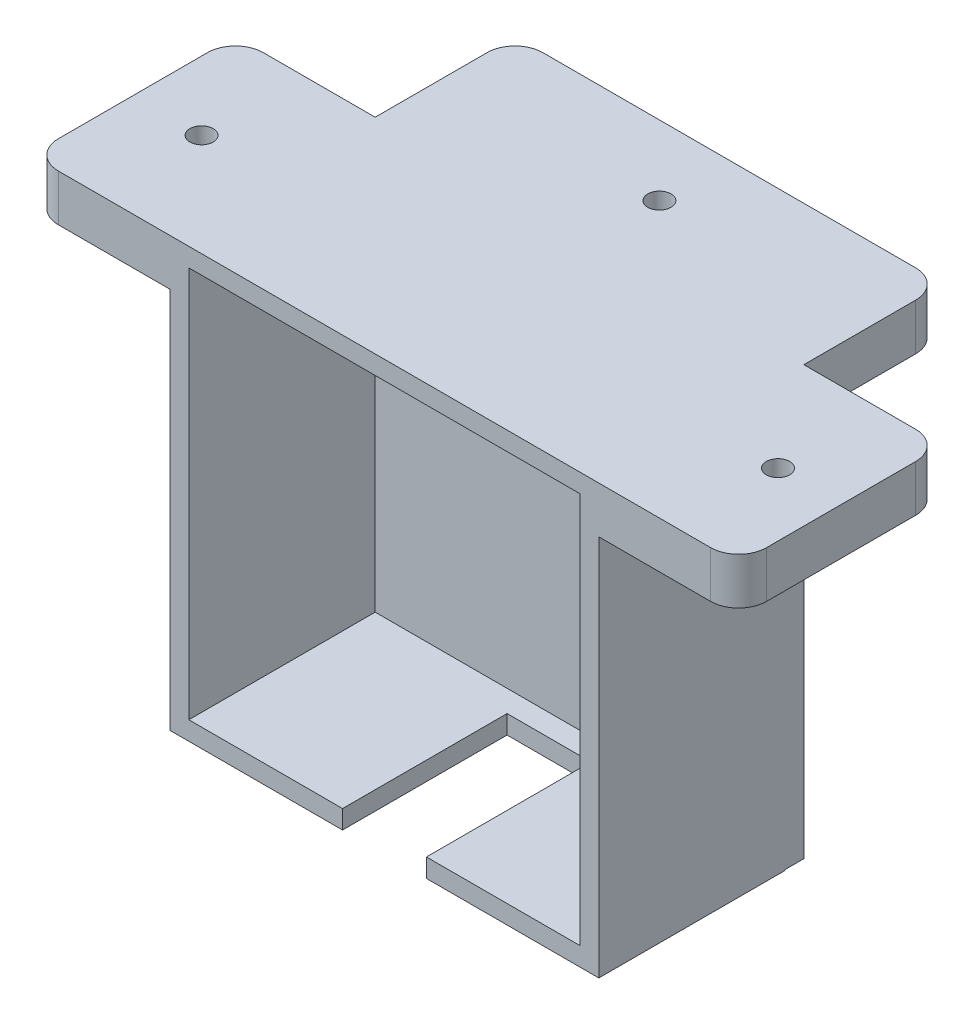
from build123d import *

# Parameters (mm, degrees)
SKETCH1_W           = 46
SKETCH1_H           = 46
SKETCH1_W_2         = 42
SKETCH1_H_2         = 42
BOSS_EXTRUDE1_DEPTH = 20
SKETCH2_W           = 46
SKETCH2_H           = 45.915924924
BOSS_EXTRUDE2_DEPTH = 2
SKETCH9_W           = 9
SKETCH9_H           = 36.840661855
CUT_EXTRUDE3_DEPTH  = 20
SKETCH11_W          = 15
SKETCH11_H          = 22
SKETCH11_W_2        = 46
SKETCH11_H_2        = 15
BOSS_EXTRUDE3_DEPTH = 5
SKETCH12_R          = 1.25
CUT_EXTRUDE4_DEPTH  = 10
FILLET1_R           = 3


with BuildPart() as part:
    # Sketch1 → Boss-Extrude1 (new body)
    with BuildSketch(Plane.XY):
        Rectangle(SKETCH1_W, SKETCH1_H)
        Rectangle(SKETCH1_W_2, SKETCH1_H_2, mode=Mode.SUBTRACT)
    extrude(amount=BOSS_EXTRUDE1_DEPTH)

    # Sketch2 → Boss-Extrude2 (add)
    with BuildSketch(Plane(origin=(0, 0, 0), x_dir=(-1, 0, 0), z_dir=(0, 0, -1))):
        with Locations((0, 0.042037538)):
            Rectangle(SKETCH2_W, SKETCH2_H)
    extrude(amount=BOSS_EXTRUDE2_DEPTH)

    # Sketch9 → Cut-Extrude3 (cut)
    with BuildSketch(Plane.XZ.offset(23)):
        with Locations((0, 20.766778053)):
            Rectangle(SKETCH9_W, SKETCH9_H)
    extrude(amount=-CUT_EXTRUDE3_DEPTH, mode=Mode.SUBTRACT)

    # Sketch11 → Boss-Extrude3 (add)
    with BuildSketch(Plane(origin=(0, 23, 0), x_dir=(1, 0, 0), z_dir=(0, 1, 0))):
        with Locations((30.5, -9)):
            Rectangle(SKETCH11_W, SKETCH11_H)
        with Locations((0, 9.5)):
            Rectangle(SKETCH11_W_2, SKETCH11_H_2)
        with Locations((-30.5, -9)):
            Rectangle(SKETCH11_W, SKETCH11_H)
    extrude(amount=-BOSS_EXTRUDE3_DEPTH)

    # Sketch12 → Cut-Extrude4 (cut)
    with BuildSketch(Plane.XZ.offset(-18)):
        with Locations(Location((-30.631211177, 9, 0), (0, 0, 270))):
            Circle(SKETCH12_R)
        with Locations(Location((0, -9.5, 0), (0, 0, 270))):
            Circle(SKETCH12_R)
        with Locations(Location((31.230647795, 9, 0), (0, 0, 270))):
            Circle(SKETCH12_R)
    extrude(amount=-CUT_EXTRUDE4_DEPTH, mode=Mode.SUBTRACT)

    # Fillet1
    fillet1_edges = [part.edges().sort_by_distance(p)[0] for p in [
        (38, 20.5, -2),
        (38, 20.5, 20),
        (-23, 20.5, -17),
        (23, 20.5, -17),
        (-38, 20.5, 20),
        (-38, 20.5, -2),
    ]]
    fillet(fillet1_edges, radius=FILLET1_R)


solid = part.part
